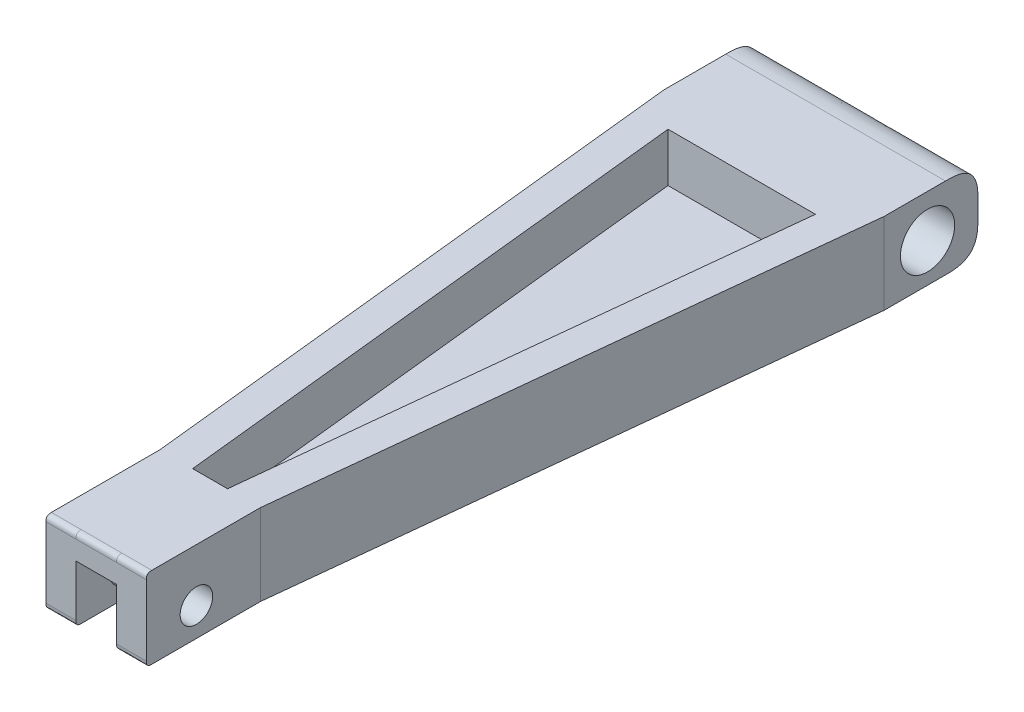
ISO-10303-21;
HEADER;
FILE_DESCRIPTION(('STEP AP214'),'2;1');
FILE_NAME('part.step','',(''),(''),'','','');
FILE_SCHEMA(('AUTOMOTIVE_DESIGN { 1 0 10303 214 1 1 1 1 }'));
ENDSEC;
DATA;
#1=APPLICATION_CONTEXT('core data for automotive mechanical design processes');
#2=APPLICATION_PROTOCOL_DEFINITION('international standard','automotive_design',2000,#1);
#3=PRODUCT_CONTEXT('',#1,'mechanical');
#4=PRODUCT('Part','Part','',(#3));
#5=PRODUCT_RELATED_PRODUCT_CATEGORY('part','',(#4));
#6=PRODUCT_DEFINITION_FORMATION('','',#4);
#7=PRODUCT_DEFINITION_CONTEXT('part definition',#1,'design');
#8=PRODUCT_DEFINITION('design','',#6,#7);
#9=PRODUCT_DEFINITION_SHAPE('','',#8);
#10=(LENGTH_UNIT() NAMED_UNIT(*) SI_UNIT(.MILLI.,.METRE.));
#11=(NAMED_UNIT(*) PLANE_ANGLE_UNIT() SI_UNIT($,.RADIAN.));
#12=(NAMED_UNIT(*) SI_UNIT($,.STERADIAN.) SOLID_ANGLE_UNIT());
#13=UNCERTAINTY_MEASURE_WITH_UNIT(LENGTH_MEASURE(1.E-05),#10,'distance_accuracy_value','');
#14=(GEOMETRIC_REPRESENTATION_CONTEXT(3) GLOBAL_UNCERTAINTY_ASSIGNED_CONTEXT((#13)) GLOBAL_UNIT_ASSIGNED_CONTEXT((#10,
#11,#12)) REPRESENTATION_CONTEXT('',''));
#15=CARTESIAN_POINT('',(0.,0.,0.));
#16=DIRECTION('',(0.,0.,1.));
#17=DIRECTION('',(1.,0.,0.));
#18=AXIS2_PLACEMENT_3D('',#15,#16,#17);
#19=CARTESIAN_POINT('',(55.,150.,0.));
#20=DIRECTION('',(-1.,0.,0.));
#21=DIRECTION('',(0.,0.,1.));
#22=AXIS2_PLACEMENT_3D('',#19,#20,#21);
#23=PLANE('',#22);
#24=CARTESIAN_POINT('',(55.,52.6570026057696,-92.2859315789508));
#25=DIRECTION('',(-1.,0.,0.));
#26=DIRECTION('',(0.,0.,1.));
#27=AXIS2_PLACEMENT_3D('',#24,#25,#26);
#28=CIRCLE('',#27,30.);
#29=CARTESIAN_POINT('',(55.,52.6570026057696,-62.2859315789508));
#30=VERTEX_POINT('',#29);
#31=EDGE_CURVE('E568',#30,#30,#28,.T.);
#32=ORIENTED_EDGE('',*,*,#31,.T.);
#33=EDGE_LOOP('',(#32));
#34=FACE_BOUND('',#33,.T.);
#35=DIRECTION('',(0.,0.,-1.));
#36=VECTOR('',#35,1.);
#37=CARTESIAN_POINT('',(55.,105.,0.));
#38=LINE('',#37,#36);
#39=CARTESIAN_POINT('',(55.,105.,0.));
#40=VERTEX_POINT('',#39);
#41=CARTESIAN_POINT('',(55.,105.,-200.));
#42=VERTEX_POINT('',#41);
#43=EDGE_CURVE('E556',#40,#42,#38,.T.);
#44=ORIENTED_EDGE('',*,*,#43,.F.);
#45=DIRECTION('',(0.,-1.,0.));
#46=VECTOR('',#45,1.);
#47=CARTESIAN_POINT('',(55.,150.,0.));
#48=LINE('',#47,#46);
#49=CARTESIAN_POINT('',(55.,10.,0.));
#50=VERTEX_POINT('',#49);
#51=EDGE_CURVE('E740',#40,#50,#48,.T.);
#52=ORIENTED_EDGE('',*,*,#51,.T.);
#53=CARTESIAN_POINT('',(54.9999999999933,0.,-10.));
#54=CARTESIAN_POINT('',(54.9999999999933,0.,-8.31801948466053));
#55=CARTESIAN_POINT('',(54.9999999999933,0.,-6.63603896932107));
#56=CARTESIAN_POINT('',(55.0000000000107,0.716919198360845,-2.92893218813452));
#57=CARTESIAN_POINT('',(55.0000000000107,2.92893218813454,-0.716919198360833));
#58=CARTESIAN_POINT('',(54.9999999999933,6.63603896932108,0.));
#59=CARTESIAN_POINT('',(54.9999999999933,8.31801948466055,0.));
#60=CARTESIAN_POINT('',(54.9999999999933,10.,0.));
#61=B_SPLINE_CURVE_WITH_KNOTS('',5,(#53,#54,#55,#56,#57,#58,#59,#60),.UNSPECIFIED.,.F.,.F.,(6,2,
6),(0.,0.5,1.),.UNSPECIFIED.);
#62=CARTESIAN_POINT('',(55.,0.,-10.));
#63=VERTEX_POINT('',#62);
#64=EDGE_CURVE('E702',#50,#63,#61,.F.);
#65=ORIENTED_EDGE('',*,*,#64,.T.);
#66=DIRECTION('',(0.,0.,-1.));
#67=VECTOR('',#66,1.);
#68=CARTESIAN_POINT('',(55.,0.,0.));
#69=LINE('',#68,#67);
#70=CARTESIAN_POINT('',(55.,0.,-270.));
#71=VERTEX_POINT('',#70);
#72=EDGE_CURVE('E78',#63,#71,#69,.T.);
#73=ORIENTED_EDGE('',*,*,#72,.T.);
#74=CARTESIAN_POINT('',(55.,70.,-200.));
#75=CARTESIAN_POINT('',(55.,0.,-200.));
#76=CARTESIAN_POINT('',(55.,0.,-270.));
#77=(BOUNDED_CURVE() B_SPLINE_CURVE(2,(#74,#75,#76),.UNSPECIFIED.,.F.,
.F.) B_SPLINE_CURVE_WITH_KNOTS((3,3),(0.,1.),
.UNSPECIFIED.) CURVE() GEOMETRIC_REPRESENTATION_ITEM() RATIONAL_B_SPLINE_CURVE((1.,
0.0526315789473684,1.)) REPRESENTATION_ITEM(''));
#78=CARTESIAN_POINT('',(55.,70.,-200.));
#79=VERTEX_POINT('',#78);
#80=EDGE_CURVE('E12',#71,#79,#77,.F.);
#81=ORIENTED_EDGE('',*,*,#80,.T.);
#82=DIRECTION('',(0.,-1.,0.));
#83=VECTOR('',#82,1.);
#84=CARTESIAN_POINT('',(55.,150.,-200.));
#85=LINE('',#84,#83);
#86=EDGE_CURVE('E637',#42,#79,#85,.T.);
#87=ORIENTED_EDGE('',*,*,#86,.F.);
#88=EDGE_LOOP('',(#44,#52,#65,#73,#81,#87));
#89=FACE_BOUND('',#88,.T.);
#90=ADVANCED_FACE('F49',(#34,#89),#23,.F.);
#91=CARTESIAN_POINT('',(55.,150.,-200.));
#92=DIRECTION('',(0.,0.,-1.));
#93=DIRECTION('',(-1.,0.,0.));
#94=AXIS2_PLACEMENT_3D('',#91,#92,#93);
#95=PLANE('',#94);
#96=ORIENTED_EDGE('',*,*,#86,.T.);
#97=CARTESIAN_POINT('',(133.75,70.,-200.));
#98=CARTESIAN_POINT('',(106.25,70.,-200.));
#99=CARTESIAN_POINT('',(78.7499999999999,70.,-200.));
#100=CARTESIAN_POINT('',(51.25,70.,-200.));
#101=(BOUNDED_CURVE() B_SPLINE_CURVE(3,(#97,#98,#99,#100),.UNSPECIFIED.,.F.,
.F.) B_SPLINE_CURVE_WITH_KNOTS((4,4),(-0.00375,0.07875),
.UNSPECIFIED.) CURVE() GEOMETRIC_REPRESENTATION_ITEM() RATIONAL_B_SPLINE_CURVE((1.,1.,1.,1.)) REPRESENTATION_ITEM(''));
#102=CARTESIAN_POINT('',(130.,70.,-200.));
#103=VERTEX_POINT('',#102);
#104=EDGE_CURVE('E628',#79,#103,#101,.F.);
#105=ORIENTED_EDGE('',*,*,#104,.T.);
#106=DIRECTION('',(0.,-1.,0.));
#107=VECTOR('',#106,1.);
#108=CARTESIAN_POINT('',(130.,150.,-200.));
#109=LINE('',#108,#107);
#110=CARTESIAN_POINT('',(130.,105.,-200.));
#111=VERTEX_POINT('',#110);
#112=EDGE_CURVE('E745',#111,#103,#109,.T.);
#113=ORIENTED_EDGE('',*,*,#112,.F.);
#114=DIRECTION('',(1.,0.,0.));
#115=VECTOR('',#114,1.);
#116=CARTESIAN_POINT('',(55.,105.,-200.));
#117=LINE('',#116,#115);
#118=EDGE_CURVE('E545',#42,#111,#117,.T.);
#119=ORIENTED_EDGE('',*,*,#118,.F.);
#120=EDGE_LOOP('',(#96,#105,#113,#119));
#121=FACE_BOUND('',#120,.T.);
#122=ADVANCED_FACE('F768',(#121),#95,.F.);
#123=CARTESIAN_POINT('',(130.,150.,-200.));
#124=DIRECTION('',(1.,0.,0.));
#125=DIRECTION('',(0.,0.,-1.));
#126=AXIS2_PLACEMENT_3D('',#123,#124,#125);
#127=PLANE('',#126);
#128=CARTESIAN_POINT('',(130.,52.6570026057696,-92.2859315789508));
#129=DIRECTION('',(1.,0.,0.));
#130=DIRECTION('',(0.,0.,-1.));
#131=AXIS2_PLACEMENT_3D('',#128,#129,#130);
#132=CIRCLE('',#131,30.);
#133=CARTESIAN_POINT('',(130.,52.6570026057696,-122.285931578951));
#134=VERTEX_POINT('',#133);
#135=EDGE_CURVE('E564',#134,#134,#132,.T.);
#136=ORIENTED_EDGE('',*,*,#135,.T.);
#137=EDGE_LOOP('',(#136));
#138=FACE_BOUND('',#137,.T.);
#139=DIRECTION('',(0.,0.,-1.));
#140=VECTOR('',#139,1.);
#141=CARTESIAN_POINT('',(130.,105.,0.));
#142=LINE('',#141,#140);
#143=CARTESIAN_POINT('',(130.,105.,0.));
#144=VERTEX_POINT('',#143);
#145=EDGE_CURVE('E550',#144,#111,#142,.T.);
#146=ORIENTED_EDGE('',*,*,#145,.T.);
#147=ORIENTED_EDGE('',*,*,#112,.T.);
#148=CARTESIAN_POINT('',(130.,0.,-270.));
#149=CARTESIAN_POINT('',(130.,0.,-200.));
#150=CARTESIAN_POINT('',(130.,70.,-200.));
#151=(BOUNDED_CURVE() B_SPLINE_CURVE(2,(#148,#149,#150),.UNSPECIFIED.,.F.,
.F.) B_SPLINE_CURVE_WITH_KNOTS((3,3),(0.,1.),
.UNSPECIFIED.) CURVE() GEOMETRIC_REPRESENTATION_ITEM() RATIONAL_B_SPLINE_CURVE((1.,
0.0526315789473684,1.)) REPRESENTATION_ITEM(''));
#152=CARTESIAN_POINT('',(130.,0.,-270.));
#153=VERTEX_POINT('',#152);
#154=EDGE_CURVE('E64',#103,#153,#151,.F.);
#155=ORIENTED_EDGE('',*,*,#154,.T.);
#156=DIRECTION('',(0.,0.,1.));
#157=VECTOR('',#156,1.);
#158=CARTESIAN_POINT('',(130.,0.,-200.));
#159=LINE('',#158,#157);
#160=CARTESIAN_POINT('',(130.,0.,-10.));
#161=VERTEX_POINT('',#160);
#162=EDGE_CURVE('E71',#153,#161,#159,.T.);
#163=ORIENTED_EDGE('',*,*,#162,.T.);
#164=CARTESIAN_POINT('',(130.,10.,0.));
#165=CARTESIAN_POINT('',(130.,8.31801948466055,0.));
#166=CARTESIAN_POINT('',(130.,6.63603896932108,0.));
#167=CARTESIAN_POINT('',(130.,2.92893218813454,-0.716919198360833));
#168=CARTESIAN_POINT('',(130.,0.716919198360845,-2.92893218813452));
#169=CARTESIAN_POINT('',(130.,0.,-6.63603896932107));
#170=CARTESIAN_POINT('',(130.,0.,-8.31801948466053));
#171=CARTESIAN_POINT('',(130.,0.,-9.99999999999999));
#172=B_SPLINE_CURVE_WITH_KNOTS('',5,(#164,#165,#166,#167,#168,#169,#170,#171),.UNSPECIFIED.,.F.,
.F.,(6,2,6),(0.,0.5,1.),.UNSPECIFIED.);
#173=CARTESIAN_POINT('',(130.,10.,0.));
#174=VERTEX_POINT('',#173);
#175=EDGE_CURVE('E727',#161,#174,#172,.F.);
#176=ORIENTED_EDGE('',*,*,#175,.T.);
#177=DIRECTION('',(0.,-1.,0.));
#178=VECTOR('',#177,1.);
#179=CARTESIAN_POINT('',(130.,150.,0.));
#180=LINE('',#179,#178);
#181=EDGE_CURVE('E280',#144,#174,#180,.T.);
#182=ORIENTED_EDGE('',*,*,#181,.F.);
#183=EDGE_LOOP('',(#146,#147,#155,#163,#176,#182));
#184=FACE_BOUND('',#183,.T.);
#185=ADVANCED_FACE('F777',(#138,#184),#127,.F.);
#186=CARTESIAN_POINT('',(0.,150.,0.));
#187=DIRECTION('',(1.,0.,0.));
#188=DIRECTION('',(0.,0.,-1.));
#189=AXIS2_PLACEMENT_3D('',#186,#187,#188);
#190=PLANE('',#189);
#191=CARTESIAN_POINT('',(0.,52.6570026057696,-92.2859315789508));
#192=DIRECTION('',(1.,0.,0.));
#193=DIRECTION('',(0.,0.,-1.));
#194=AXIS2_PLACEMENT_3D('',#191,#192,#193);
#195=CIRCLE('',#194,30.);
#196=CARTESIAN_POINT('',(0.,52.6570026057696,-122.285931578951));
#197=VERTEX_POINT('',#196);
#198=EDGE_CURVE('E378',#197,#197,#195,.T.);
#199=ORIENTED_EDGE('',*,*,#198,.T.);
#200=EDGE_LOOP('',(#199));
#201=FACE_BOUND('',#200,.T.);
#202=DIRECTION('',(0.,0.,1.));
#203=VECTOR('',#202,1.);
#204=CARTESIAN_POINT('',(0.,0.,0.));
#205=LINE('',#204,#203);
#206=CARTESIAN_POINT('',(0.,0.,-210.));
#207=VERTEX_POINT('',#206);
#208=CARTESIAN_POINT('',(0.,0.,-9.99999999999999));
#209=VERTEX_POINT('',#208);
#210=EDGE_CURVE('E375',#207,#209,#205,.T.);
#211=ORIENTED_EDGE('',*,*,#210,.T.);
#212=CARTESIAN_POINT('',(-3.19731220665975E-13,10.,0.));
#213=CARTESIAN_POINT('',(-3.19731220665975E-13,8.31801948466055,0.));
#214=CARTESIAN_POINT('',(-3.19731220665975E-13,6.63603896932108,0.));
#215=CARTESIAN_POINT('',(5.07948717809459E-13,2.92893218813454,-0.716919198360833));
#216=CARTESIAN_POINT('',(5.07948717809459E-13,0.716919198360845,-2.92893218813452));
#217=CARTESIAN_POINT('',(-3.19731220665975E-13,0.,-6.63603896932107));
#218=CARTESIAN_POINT('',(-3.19731220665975E-13,0.,-8.31801948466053));
#219=CARTESIAN_POINT('',(-3.19731220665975E-13,0.,-10.));
#220=B_SPLINE_CURVE_WITH_KNOTS('',5,(#212,#213,#214,#215,#216,#217,#218,#219),.UNSPECIFIED.,.F.,
.F.,(6,2,6),(0.,0.5,1.),.UNSPECIFIED.);
#221=CARTESIAN_POINT('',(0.,10.,0.));
#222=VERTEX_POINT('',#221);
#223=EDGE_CURVE('E691',#209,#222,#220,.F.);
#224=ORIENTED_EDGE('',*,*,#223,.T.);
#225=DIRECTION('',(0.,-1.,0.));
#226=VECTOR('',#225,1.);
#227=CARTESIAN_POINT('',(0.,150.,0.));
#228=LINE('',#227,#226);
#229=CARTESIAN_POINT('',(0.,140.,0.));
#230=VERTEX_POINT('',#229);
#231=EDGE_CURVE('E738',#230,#222,#228,.T.);
#232=ORIENTED_EDGE('',*,*,#231,.F.);
#233=CARTESIAN_POINT('',(-3.21899625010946E-13,150.,-10.));
#234=CARTESIAN_POINT('',(-3.21899625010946E-13,150.,-8.31801948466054));
#235=CARTESIAN_POINT('',(-3.21899625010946E-13,150.,-6.63603896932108));
#236=CARTESIAN_POINT('',(5.05888733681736E-13,149.283080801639,-2.92893218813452));
#237=CARTESIAN_POINT('',(5.05888733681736E-13,147.071067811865,-0.716919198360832));
#238=CARTESIAN_POINT('',(-3.21899625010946E-13,143.363961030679,0.));
#239=CARTESIAN_POINT('',(-3.21899625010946E-13,141.681980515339,0.));
#240=CARTESIAN_POINT('',(-3.21899625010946E-13,140.,0.));
#241=B_SPLINE_CURVE_WITH_KNOTS('',5,(#233,#234,#235,#236,#237,#238,#239,#240),.UNSPECIFIED.,.F.,
.F.,(6,2,6),(0.,0.5,1.),.UNSPECIFIED.);
#242=CARTESIAN_POINT('',(0.,150.,-10.));
#243=VERTEX_POINT('',#242);
#244=EDGE_CURVE('E696',#230,#243,#241,.F.);
#245=ORIENTED_EDGE('',*,*,#244,.T.);
#246=DIRECTION('',(0.,0.,1.));
#247=VECTOR('',#246,1.);
#248=CARTESIAN_POINT('',(0.,150.,0.));
#249=LINE('',#248,#247);
#250=CARTESIAN_POINT('',(0.,150.,-210.));
#251=VERTEX_POINT('',#250);
#252=EDGE_CURVE('E354',#251,#243,#249,.T.);
#253=ORIENTED_EDGE('',*,*,#252,.F.);
#254=DIRECTION('',(0.,-1.,0.));
#255=VECTOR('',#254,1.);
#256=CARTESIAN_POINT('',(0.,150.,-210.));
#257=LINE('',#256,#255);
#258=EDGE_CURVE('E267',#251,#207,#257,.T.);
#259=ORIENTED_EDGE('',*,*,#258,.T.);
#260=EDGE_LOOP('',(#211,#224,#232,#245,#253,#259));
#261=FACE_BOUND('',#260,.T.);
#262=ADVANCED_FACE('F783',(#201,#261),#190,.F.);
#263=CARTESIAN_POINT('',(130.,150.,0.));
#264=DIRECTION('',(0.,0.,-1.));
#265=DIRECTION('',(-1.,0.,0.));
#266=AXIS2_PLACEMENT_3D('',#263,#264,#265);
#267=PLANE('',#266);
#268=CARTESIAN_POINT('',(127.25,140.,0.));
#269=CARTESIAN_POINT('',(147.416666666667,140.,0.));
#270=CARTESIAN_POINT('',(167.583333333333,140.,0.));
#271=CARTESIAN_POINT('',(187.75,140.,0.));
#272=B_SPLINE_CURVE_WITH_KNOTS('',3,(#268,#269,#270,#271),.UNSPECIFIED.,.F.,.F.,(4,4),(-0.18775,
-0.12725),.UNSPECIFIED.);
#273=CARTESIAN_POINT('',(185.,140.,0.));
#274=VERTEX_POINT('',#273);
#275=CARTESIAN_POINT('',(130.,140.,0.));
#276=VERTEX_POINT('',#275);
#277=EDGE_CURVE('E332',#274,#276,#272,.F.);
#278=ORIENTED_EDGE('',*,*,#277,.T.);
#279=CARTESIAN_POINT('',(51.25,140.,0.));
#280=CARTESIAN_POINT('',(78.75,140.,0.));
#281=CARTESIAN_POINT('',(106.249999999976,140.,0.));
#282=CARTESIAN_POINT('',(133.75,140.,0.));
#283=B_SPLINE_CURVE_WITH_KNOTS('',3,(#279,#280,#281,#282),.UNSPECIFIED.,.F.,.F.,(4,4),(-0.07875,
0.00375),.UNSPECIFIED.);
#284=CARTESIAN_POINT('',(55.,140.,0.));
#285=VERTEX_POINT('',#284);
#286=EDGE_CURVE('E689',#276,#285,#283,.F.);
#287=ORIENTED_EDGE('',*,*,#286,.T.);
#288=CARTESIAN_POINT('',(-2.75,140.,0.));
#289=CARTESIAN_POINT('',(17.4166666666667,140.,0.));
#290=CARTESIAN_POINT('',(37.5833333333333,140.,0.));
#291=CARTESIAN_POINT('',(57.75,140.,0.));
#292=B_SPLINE_CURVE_WITH_KNOTS('',3,(#288,#289,#290,#291),.UNSPECIFIED.,.F.,.F.,(4,4),(-0.05775,
0.00275),.UNSPECIFIED.);
#293=EDGE_CURVE('E715',#285,#230,#292,.F.);
#294=ORIENTED_EDGE('',*,*,#293,.T.);
#295=ORIENTED_EDGE('',*,*,#231,.T.);
#296=CARTESIAN_POINT('',(57.75,10.,0.));
#297=CARTESIAN_POINT('',(37.5833333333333,10.,0.));
#298=CARTESIAN_POINT('',(17.4166666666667,10.,0.));
#299=CARTESIAN_POINT('',(-2.75,10.,0.));
#300=B_SPLINE_CURVE_WITH_KNOTS('',3,(#296,#297,#298,#299),.UNSPECIFIED.,.F.,.F.,(4,4),(-0.00275,
0.05775),.UNSPECIFIED.);
#301=EDGE_CURVE('E710',#222,#50,#300,.F.);
#302=ORIENTED_EDGE('',*,*,#301,.T.);
#303=ORIENTED_EDGE('',*,*,#51,.F.);
#304=DIRECTION('',(1.,0.,0.));
#305=VECTOR('',#304,1.);
#306=CARTESIAN_POINT('',(55.,105.,0.));
#307=LINE('',#306,#305);
#308=EDGE_CURVE('E546',#40,#144,#307,.T.);
#309=ORIENTED_EDGE('',*,*,#308,.T.);
#310=ORIENTED_EDGE('',*,*,#181,.T.);
#311=CARTESIAN_POINT('',(187.75,10.,0.));
#312=CARTESIAN_POINT('',(167.583333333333,10.,0.));
#313=CARTESIAN_POINT('',(147.416666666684,10.,0.));
#314=CARTESIAN_POINT('',(127.25,10.,0.));
#315=B_SPLINE_CURVE_WITH_KNOTS('',3,(#311,#312,#313,#314),.UNSPECIFIED.,.F.,.F.,(4,4),(-0.00275,
0.05775),.UNSPECIFIED.);
#316=CARTESIAN_POINT('',(185.,10.,0.));
#317=VERTEX_POINT('',#316);
#318=EDGE_CURVE('E320',#174,#317,#315,.F.);
#319=ORIENTED_EDGE('',*,*,#318,.T.);
#320=DIRECTION('',(0.,-1.,0.));
#321=VECTOR('',#320,1.);
#322=CARTESIAN_POINT('',(185.,150.,0.));
#323=LINE('',#322,#321);
#324=EDGE_CURVE('E264',#274,#317,#323,.T.);
#325=ORIENTED_EDGE('',*,*,#324,.F.);
#326=EDGE_LOOP('',(#278,#287,#294,#295,#302,#303,#309,#310,#319,#325));
#327=FACE_BOUND('',#326,.T.);
#328=ADVANCED_FACE('F301',(#327),#267,.F.);
#329=CARTESIAN_POINT('',(185.,150.,0.));
#330=DIRECTION('',(-1.,0.,0.));
#331=DIRECTION('',(0.,0.,1.));
#332=AXIS2_PLACEMENT_3D('',#329,#330,#331);
#333=PLANE('',#332);
#334=CARTESIAN_POINT('',(185.,52.6570026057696,-92.2859315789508));
#335=DIRECTION('',(1.,0.,0.));
#336=DIRECTION('',(0.,0.,-1.));
#337=AXIS2_PLACEMENT_3D('',#334,#335,#336);
#338=CIRCLE('',#337,30.);
#339=CARTESIAN_POINT('',(185.,52.6570026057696,-122.285931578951));
#340=VERTEX_POINT('',#339);
#341=EDGE_CURVE('E560',#340,#340,#338,.T.);
#342=ORIENTED_EDGE('',*,*,#341,.F.);
#343=EDGE_LOOP('',(#342));
#344=FACE_BOUND('',#343,.T.);
#345=DIRECTION('',(0.,0.,-1.));
#346=VECTOR('',#345,1.);
#347=CARTESIAN_POINT('',(185.,150.,0.));
#348=LINE('',#347,#346);
#349=CARTESIAN_POINT('',(185.,150.,-9.99999999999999));
#350=VERTEX_POINT('',#349);
#351=CARTESIAN_POINT('',(185.,150.,-210.));
#352=VERTEX_POINT('',#351);
#353=EDGE_CURVE('E370',#350,#352,#348,.T.);
#354=ORIENTED_EDGE('',*,*,#353,.F.);
#355=CARTESIAN_POINT('',(185.,140.,0.));
#356=CARTESIAN_POINT('',(185.,141.681980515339,0.));
#357=CARTESIAN_POINT('',(185.,143.363961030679,0.));
#358=CARTESIAN_POINT('',(185.,147.071067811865,-0.716919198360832));
#359=CARTESIAN_POINT('',(185.,149.283080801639,-2.92893218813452));
#360=CARTESIAN_POINT('',(185.,150.,-6.63603896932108));
#361=CARTESIAN_POINT('',(185.,150.,-8.31801948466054));
#362=CARTESIAN_POINT('',(185.,150.,-9.99999999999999));
#363=B_SPLINE_CURVE_WITH_KNOTS('',5,(#355,#356,#357,#358,#359,#360,#361,#362),.UNSPECIFIED.,.F.,
.F.,(6,2,6),(0.,0.5,1.),.UNSPECIFIED.);
#364=EDGE_CURVE('E615',#350,#274,#363,.F.);
#365=ORIENTED_EDGE('',*,*,#364,.T.);
#366=ORIENTED_EDGE('',*,*,#324,.T.);
#367=CARTESIAN_POINT('',(185.,0.,-10.));
#368=CARTESIAN_POINT('',(185.,0.,-8.31801948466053));
#369=CARTESIAN_POINT('',(185.,0.,-6.63603896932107));
#370=CARTESIAN_POINT('',(185.,0.716919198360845,-2.92893218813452));
#371=CARTESIAN_POINT('',(185.,2.92893218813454,-0.716919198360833));
#372=CARTESIAN_POINT('',(185.,6.63603896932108,0.));
#373=CARTESIAN_POINT('',(185.,8.31801948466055,0.));
#374=CARTESIAN_POINT('',(185.,10.,0.));
#375=B_SPLINE_CURVE_WITH_KNOTS('',5,(#367,#368,#369,#370,#371,#372,#373,#374),.UNSPECIFIED.,.F.,
.F.,(6,2,6),(0.,0.5,1.),.UNSPECIFIED.);
#376=CARTESIAN_POINT('',(185.,0.,-10.));
#377=VERTEX_POINT('',#376);
#378=EDGE_CURVE('E285',#317,#377,#375,.F.);
#379=ORIENTED_EDGE('',*,*,#378,.T.);
#380=DIRECTION('',(0.,0.,-1.));
#381=VECTOR('',#380,1.);
#382=CARTESIAN_POINT('',(185.,0.,0.));
#383=LINE('',#382,#381);
#384=CARTESIAN_POINT('',(185.,0.,-210.));
#385=VERTEX_POINT('',#384);
#386=EDGE_CURVE('E253',#377,#385,#383,.T.);
#387=ORIENTED_EDGE('',*,*,#386,.T.);
#388=DIRECTION('',(0.,-1.,0.));
#389=VECTOR('',#388,1.);
#390=CARTESIAN_POINT('',(185.,150.,-210.));
#391=LINE('',#390,#389);
#392=EDGE_CURVE('E250',#352,#385,#391,.T.);
#393=ORIENTED_EDGE('',*,*,#392,.F.);
#394=EDGE_LOOP('',(#354,#365,#366,#379,#387,#393));
#395=FACE_BOUND('',#394,.T.);
#396=ADVANCED_FACE('F291',(#344,#395),#333,.F.);
#397=CARTESIAN_POINT('',(185.,150.,-210.));
#398=DIRECTION('',(-0.994452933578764,0.,-0.105182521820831));
#399=DIRECTION('',(-0.105182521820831,0.,0.994452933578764));
#400=AXIS2_PLACEMENT_3D('',#397,#398,#399);
#401=PLANE('',#400);
#402=DIRECTION('',(0.105182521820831,0.,-0.994452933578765));
#403=VECTOR('',#402,1.);
#404=CARTESIAN_POINT('',(185.,0.,-210.));
#405=LINE('',#404,#403);
#406=CARTESIAN_POINT('',(295.,0.,-1250.));
#407=VERTEX_POINT('',#406);
#408=EDGE_CURVE('E231',#385,#407,#405,.T.);
#409=ORIENTED_EDGE('',*,*,#408,.T.);
#410=DIRECTION('',(0.,-1.,0.));
#411=VECTOR('',#410,1.);
#412=CARTESIAN_POINT('',(295.,150.,-1250.));
#413=LINE('',#412,#411);
#414=CARTESIAN_POINT('',(295.,150.,-1250.));
#415=VERTEX_POINT('',#414);
#416=EDGE_CURVE('E248',#415,#407,#413,.T.);
#417=ORIENTED_EDGE('',*,*,#416,.F.);
#418=DIRECTION('',(0.105182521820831,0.,-0.994452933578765));
#419=VECTOR('',#418,1.);
#420=CARTESIAN_POINT('',(185.,150.,-210.));
#421=LINE('',#420,#419);
#422=EDGE_CURVE('E364',#352,#415,#421,.T.);
#423=ORIENTED_EDGE('',*,*,#422,.F.);
#424=ORIENTED_EDGE('',*,*,#392,.T.);
#425=EDGE_LOOP('',(#409,#417,#423,#424));
#426=FACE_BOUND('',#425,.T.);
#427=ADVANCED_FACE('F246',(#426),#401,.F.);
#428=CARTESIAN_POINT('',(0.,150.,-210.));
#429=DIRECTION('',(0.994452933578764,0.,-0.105182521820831));
#430=DIRECTION('',(-0.105182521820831,0.,-0.994452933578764));
#431=AXIS2_PLACEMENT_3D('',#428,#429,#430);
#432=PLANE('',#431);
#433=DIRECTION('',(0.105182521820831,0.,0.994452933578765));
#434=VECTOR('',#433,1.);
#435=CARTESIAN_POINT('',(0.,0.,-210.));
#436=LINE('',#435,#434);
#437=CARTESIAN_POINT('',(-110.,0.,-1250.));
#438=VERTEX_POINT('',#437);
#439=EDGE_CURVE('E252',#438,#207,#436,.T.);
#440=ORIENTED_EDGE('',*,*,#439,.T.);
#441=ORIENTED_EDGE('',*,*,#258,.F.);
#442=DIRECTION('',(0.105182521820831,0.,0.994452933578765));
#443=VECTOR('',#442,1.);
#444=CARTESIAN_POINT('',(0.,150.,-210.));
#445=LINE('',#444,#443);
#446=CARTESIAN_POINT('',(-110.,150.,-1250.));
#447=VERTEX_POINT('',#446);
#448=EDGE_CURVE('E357',#447,#251,#445,.T.);
#449=ORIENTED_EDGE('',*,*,#448,.F.);
#450=DIRECTION('',(0.,-1.,0.));
#451=VECTOR('',#450,1.);
#452=CARTESIAN_POINT('',(-110.,150.,-1250.));
#453=LINE('',#452,#451);
#454=EDGE_CURVE('E260',#447,#438,#453,.T.);
#455=ORIENTED_EDGE('',*,*,#454,.T.);
#456=EDGE_LOOP('',(#440,#441,#449,#455));
#457=FACE_BOUND('',#456,.T.);
#458=ADVANCED_FACE('F403',(#457),#432,.F.);
#459=CARTESIAN_POINT('',(0.,150.,0.));
#460=DIRECTION('',(0.,1.,0.));
#461=DIRECTION('',(0.,0.,1.));
#462=AXIS2_PLACEMENT_3D('',#459,#460,#461);
#463=PLANE('',#462);
#464=DIRECTION('',(0.,0.,1.));
#465=VECTOR('',#464,1.);
#466=CARTESIAN_POINT('',(60.,150.,0.));
#467=LINE('',#466,#465);
#468=CARTESIAN_POINT('',(60.,150.,-213.164251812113));
#469=VERTEX_POINT('',#468);
#470=CARTESIAN_POINT('',(60.,150.,-210.));
#471=VERTEX_POINT('',#470);
#472=EDGE_CURVE('E500',#469,#471,#467,.T.);
#473=ORIENTED_EDGE('',*,*,#472,.F.);
#474=DIRECTION('',(0.105182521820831,0.,0.994452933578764));
#475=VECTOR('',#474,1.);
#476=CARTESIAN_POINT('',(59.6671760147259,150.,-216.31095130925));
#477=LINE('',#476,#475);
#478=CARTESIAN_POINT('',(-43.3191656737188,150.,-1190.));
#479=VERTEX_POINT('',#478);
#480=EDGE_CURVE('E495',#479,#469,#477,.T.);
#481=ORIENTED_EDGE('',*,*,#480,.F.);
#482=DIRECTION('',(-1.,0.,0.));
#483=VECTOR('',#482,1.);
#484=CARTESIAN_POINT('',(295.,150.,-1190.));
#485=LINE('',#484,#483);
#486=CARTESIAN_POINT('',(228.319165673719,150.,-1190.));
#487=VERTEX_POINT('',#486);
#488=EDGE_CURVE('E527',#487,#479,#485,.T.);
#489=ORIENTED_EDGE('',*,*,#488,.F.);
#490=DIRECTION('',(0.105182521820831,0.,-0.994452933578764));
#491=VECTOR('',#490,1.);
#492=CARTESIAN_POINT('',(125.332823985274,150.,-216.31095130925));
#493=LINE('',#492,#491);
#494=CARTESIAN_POINT('',(125.,150.,-213.164251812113));
#495=VERTEX_POINT('',#494);
#496=EDGE_CURVE('E524',#495,#487,#493,.T.);
#497=ORIENTED_EDGE('',*,*,#496,.F.);
#498=DIRECTION('',(0.,0.,-1.));
#499=VECTOR('',#498,1.);
#500=CARTESIAN_POINT('',(125.,150.,0.));
#501=LINE('',#500,#499);
#502=CARTESIAN_POINT('',(125.,150.,-210.));
#503=VERTEX_POINT('',#502);
#504=EDGE_CURVE('E521',#503,#495,#501,.T.);
#505=ORIENTED_EDGE('',*,*,#504,.F.);
#506=DIRECTION('',(1.,0.,0.));
#507=VECTOR('',#506,1.);
#508=CARTESIAN_POINT('',(55.,150.,-210.));
#509=LINE('',#508,#507);
#510=EDGE_CURVE('E541',#471,#503,#509,.T.);
#511=ORIENTED_EDGE('',*,*,#510,.F.);
#512=EDGE_LOOP('',(#473,#481,#489,#497,#505,#511));
#513=FACE_BOUND('',#512,.T.);
#514=DIRECTION('',(0.,0.,1.));
#515=VECTOR('',#514,1.);
#516=CARTESIAN_POINT('',(295.,150.,-1423.));
#517=LINE('',#516,#515);
#518=CARTESIAN_POINT('',(295.,150.,-1363.));
#519=VERTEX_POINT('',#518);
#520=EDGE_CURVE('E257',#519,#415,#517,.T.);
#521=ORIENTED_EDGE('',*,*,#520,.F.);
#522=CARTESIAN_POINT('',(-130.25,150.,-1363.));
#523=CARTESIAN_POINT('',(18.25,150.,-1363.));
#524=CARTESIAN_POINT('',(166.75,150.,-1363.));
#525=CARTESIAN_POINT('',(315.25,150.,-1363.));
#526=B_SPLINE_CURVE_WITH_KNOTS('',3,(#522,#523,#524,#525),.UNSPECIFIED.,.F.,.F.,(4,4),(-0.13025,
0.31525),.UNSPECIFIED.);
#527=CARTESIAN_POINT('',(-110.,150.,-1363.));
#528=VERTEX_POINT('',#527);
#529=EDGE_CURVE('E617',#519,#528,#526,.F.);
#530=ORIENTED_EDGE('',*,*,#529,.T.);
#531=DIRECTION('',(0.,0.,1.));
#532=VECTOR('',#531,1.);
#533=CARTESIAN_POINT('',(-110.,150.,-1423.));
#534=LINE('',#533,#532);
#535=EDGE_CURVE('E423',#528,#447,#534,.T.);
#536=ORIENTED_EDGE('',*,*,#535,.T.);
#537=ORIENTED_EDGE('',*,*,#448,.T.);
#538=ORIENTED_EDGE('',*,*,#252,.T.);
#539=CARTESIAN_POINT('',(57.75,150.,-10.));
#540=CARTESIAN_POINT('',(37.5833333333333,150.,-10.));
#541=CARTESIAN_POINT('',(17.4166666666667,150.,-10.));
#542=CARTESIAN_POINT('',(-2.75,150.,-10.));
#543=B_SPLINE_CURVE_WITH_KNOTS('',3,(#539,#540,#541,#542),.UNSPECIFIED.,.F.,.F.,(4,4),(-0.05775,
0.00275),.UNSPECIFIED.);
#544=CARTESIAN_POINT('',(55.,150.,-10.));
#545=VERTEX_POINT('',#544);
#546=EDGE_CURVE('E588',#243,#545,#543,.F.);
#547=ORIENTED_EDGE('',*,*,#546,.T.);
#548=CARTESIAN_POINT('',(133.75,150.,-10.));
#549=CARTESIAN_POINT('',(106.249999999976,150.,-10.));
#550=CARTESIAN_POINT('',(78.75,150.,-10.));
#551=CARTESIAN_POINT('',(51.25,150.,-10.));
#552=B_SPLINE_CURVE_WITH_KNOTS('',3,(#548,#549,#550,#551),.UNSPECIFIED.,.F.,.F.,(4,4),(-0.07875,
0.00375),.UNSPECIFIED.);
#553=CARTESIAN_POINT('',(130.,150.,-9.99999999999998));
#554=VERTEX_POINT('',#553);
#555=EDGE_CURVE('E609',#545,#554,#552,.F.);
#556=ORIENTED_EDGE('',*,*,#555,.T.);
#557=CARTESIAN_POINT('',(187.75,150.,-10.));
#558=CARTESIAN_POINT('',(167.583333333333,150.,-10.));
#559=CARTESIAN_POINT('',(147.416666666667,150.,-10.));
#560=CARTESIAN_POINT('',(127.25,150.,-10.));
#561=B_SPLINE_CURVE_WITH_KNOTS('',3,(#557,#558,#559,#560),.UNSPECIFIED.,.F.,.F.,(4,4),(-0.18775,
-0.12725),.UNSPECIFIED.);
#562=EDGE_CURVE('E600',#554,#350,#561,.F.);
#563=ORIENTED_EDGE('',*,*,#562,.T.);
#564=ORIENTED_EDGE('',*,*,#353,.T.);
#565=ORIENTED_EDGE('',*,*,#422,.T.);
#566=EDGE_LOOP('',(#521,#530,#536,#537,#538,#547,#556,#563,#564,#565));
#567=FACE_BOUND('',#566,.T.);
#568=ADVANCED_FACE('F400',(#513,#567),#463,.T.);
#569=CARTESIAN_POINT('',(0.,0.,0.));
#570=DIRECTION('',(0.,1.,0.));
#571=DIRECTION('',(0.,0.,1.));
#572=AXIS2_PLACEMENT_3D('',#569,#570,#571);
#573=PLANE('',#572);
#574=ORIENTED_EDGE('',*,*,#162,.F.);
#575=CARTESIAN_POINT('',(51.25,0.,-270.));
#576=CARTESIAN_POINT('',(78.7499999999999,0.,-270.));
#577=CARTESIAN_POINT('',(106.25,0.,-270.));
#578=CARTESIAN_POINT('',(133.75,0.,-270.));
#579=(BOUNDED_CURVE() B_SPLINE_CURVE(3,(#575,#576,#577,#578),.UNSPECIFIED.,.F.,
.F.) B_SPLINE_CURVE_WITH_KNOTS((4,4),(-0.00375,0.07875),
.UNSPECIFIED.) CURVE() GEOMETRIC_REPRESENTATION_ITEM() RATIONAL_B_SPLINE_CURVE((1.,1.,1.,1.)) REPRESENTATION_ITEM(''));
#580=EDGE_CURVE('E830',#153,#71,#579,.F.);
#581=ORIENTED_EDGE('',*,*,#580,.T.);
#582=ORIENTED_EDGE('',*,*,#72,.F.);
#583=CARTESIAN_POINT('',(-2.75,0.,-10.));
#584=CARTESIAN_POINT('',(17.4166666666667,0.,-10.));
#585=CARTESIAN_POINT('',(37.5833333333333,0.,-10.));
#586=CARTESIAN_POINT('',(57.75,0.,-10.));
#587=B_SPLINE_CURVE_WITH_KNOTS('',3,(#583,#584,#585,#586),.UNSPECIFIED.,.F.,.F.,(4,4),(-0.00275,
0.05775),.UNSPECIFIED.);
#588=EDGE_CURVE('E385',#63,#209,#587,.F.);
#589=ORIENTED_EDGE('',*,*,#588,.T.);
#590=ORIENTED_EDGE('',*,*,#210,.F.);
#591=ORIENTED_EDGE('',*,*,#439,.F.);
#592=DIRECTION('',(0.,0.,1.));
#593=VECTOR('',#592,1.);
#594=CARTESIAN_POINT('',(-110.,0.,-1423.));
#595=LINE('',#594,#593);
#596=CARTESIAN_POINT('',(-110.,0.,-1363.));
#597=VERTEX_POINT('',#596);
#598=EDGE_CURVE('E241',#597,#438,#595,.T.);
#599=ORIENTED_EDGE('',*,*,#598,.F.);
#600=CARTESIAN_POINT('',(315.25,0.,-1363.));
#601=CARTESIAN_POINT('',(166.75,0.,-1363.));
#602=CARTESIAN_POINT('',(18.25,0.,-1363.));
#603=CARTESIAN_POINT('',(-130.25,0.,-1363.));
#604=B_SPLINE_CURVE_WITH_KNOTS('',3,(#600,#601,#602,#603),.UNSPECIFIED.,.F.,.F.,(4,4),(-0.13025,
0.31525),.UNSPECIFIED.);
#605=CARTESIAN_POINT('',(295.,0.,-1363.));
#606=VERTEX_POINT('',#605);
#607=EDGE_CURVE('E234',#597,#606,#604,.F.);
#608=ORIENTED_EDGE('',*,*,#607,.T.);
#609=DIRECTION('',(0.,0.,1.));
#610=VECTOR('',#609,1.);
#611=CARTESIAN_POINT('',(295.,0.,-1423.));
#612=LINE('',#611,#610);
#613=EDGE_CURVE('E227',#606,#407,#612,.T.);
#614=ORIENTED_EDGE('',*,*,#613,.T.);
#615=ORIENTED_EDGE('',*,*,#408,.F.);
#616=ORIENTED_EDGE('',*,*,#386,.F.);
#617=CARTESIAN_POINT('',(127.25,0.,-10.));
#618=CARTESIAN_POINT('',(147.416666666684,0.,-10.));
#619=CARTESIAN_POINT('',(167.583333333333,0.,-10.));
#620=CARTESIAN_POINT('',(187.75,0.,-10.));
#621=B_SPLINE_CURVE_WITH_KNOTS('',3,(#617,#618,#619,#620),.UNSPECIFIED.,.F.,.F.,(4,4),(-0.00275,
0.05775),.UNSPECIFIED.);
#622=EDGE_CURVE('E720',#377,#161,#621,.F.);
#623=ORIENTED_EDGE('',*,*,#622,.T.);
#624=EDGE_LOOP('',(#574,#581,#582,#589,#590,#591,#599,#608,#614,#615,#616,#623));
#625=FACE_BOUND('',#624,.T.);
#626=ADVANCED_FACE('F229',(#625),#573,.F.);
#627=CARTESIAN_POINT('',(-110.,52.6570026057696,-92.2859315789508));
#628=DIRECTION('',(1.,0.,0.));
#629=DIRECTION('',(0.,0.,-1.));
#630=AXIS2_PLACEMENT_3D('',#627,#628,#629);
#631=CYLINDRICAL_SURFACE('',#630,30.);
#632=ORIENTED_EDGE('',*,*,#341,.T.);
#633=EDGE_LOOP('',(#632));
#634=FACE_BOUND('',#633,.T.);
#635=ORIENTED_EDGE('',*,*,#135,.F.);
#636=EDGE_LOOP('',(#635));
#637=FACE_BOUND('',#636,.T.);
#638=ADVANCED_FACE('F399',(#634,#637),#631,.F.);
#639=ORIENTED_EDGE('',*,*,#31,.F.);
#640=EDGE_LOOP('',(#639));
#641=FACE_BOUND('',#640,.T.);
#642=ORIENTED_EDGE('',*,*,#198,.F.);
#643=EDGE_LOOP('',(#642));
#644=FACE_BOUND('',#643,.T.);
#645=ADVANCED_FACE('F957',(#641,#644),#631,.F.);
#646=CARTESIAN_POINT('',(187.75,140.,0.));
#647=CARTESIAN_POINT('',(167.583333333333,140.,0.));
#648=CARTESIAN_POINT('',(147.416666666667,140.,0.));
#649=CARTESIAN_POINT('',(127.25,140.,0.));
#650=CARTESIAN_POINT('',(187.75,141.681980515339,0.));
#651=CARTESIAN_POINT('',(167.583333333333,141.681980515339,0.));
#652=CARTESIAN_POINT('',(147.416666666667,141.681980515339,0.));
#653=CARTESIAN_POINT('',(127.25,141.681980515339,0.));
#654=CARTESIAN_POINT('',(187.75,143.363961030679,0.));
#655=CARTESIAN_POINT('',(167.583333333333,143.363961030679,0.));
#656=CARTESIAN_POINT('',(147.416666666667,143.363961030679,0.));
#657=CARTESIAN_POINT('',(127.25,143.363961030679,0.));
#658=CARTESIAN_POINT('',(187.75,147.071067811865,-0.716919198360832));
#659=CARTESIAN_POINT('',(167.583333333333,147.071067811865,-0.716919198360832));
#660=CARTESIAN_POINT('',(147.416666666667,147.071067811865,-0.716919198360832));
#661=CARTESIAN_POINT('',(127.25,147.071067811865,-0.716919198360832));
#662=CARTESIAN_POINT('',(187.75,149.283080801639,-2.92893218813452));
#663=CARTESIAN_POINT('',(167.583333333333,149.283080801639,-2.92893218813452));
#664=CARTESIAN_POINT('',(147.416666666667,149.283080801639,-2.92893218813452));
#665=CARTESIAN_POINT('',(127.25,149.283080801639,-2.92893218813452));
#666=CARTESIAN_POINT('',(187.75,150.,-6.63603896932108));
#667=CARTESIAN_POINT('',(167.583333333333,150.,-6.63603896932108));
#668=CARTESIAN_POINT('',(147.416666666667,150.,-6.63603896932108));
#669=CARTESIAN_POINT('',(127.25,150.,-6.63603896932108));
#670=CARTESIAN_POINT('',(187.75,150.,-8.31801948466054));
#671=CARTESIAN_POINT('',(167.583333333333,150.,-8.31801948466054));
#672=CARTESIAN_POINT('',(147.416666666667,150.,-8.31801948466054));
#673=CARTESIAN_POINT('',(127.25,150.,-8.31801948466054));
#674=CARTESIAN_POINT('',(187.75,150.,-10.));
#675=CARTESIAN_POINT('',(167.583333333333,150.,-10.));
#676=CARTESIAN_POINT('',(147.416666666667,150.,-10.));
#677=CARTESIAN_POINT('',(127.25,150.,-10.));
#678=B_SPLINE_SURFACE_WITH_KNOTS('',5,3,((#646,#647,#648,#649),(#650,#651,#652,#653),(#654,#655,
#656,#657),(#658,#659,#660,#661),(#662,#663,#664,#665),(#666,#667,#668,#669),(#670,#671,#672,
#673),(#674,#675,#676,#677)),.UNSPECIFIED.,.F.,.F.,.F.,(6,2,6),(4,4),(0.,0.5,1.),(-0.18775,
-0.12725),.UNSPECIFIED.);
#679=CARTESIAN_POINT('',(130.,140.,0.));
#680=CARTESIAN_POINT('',(130.,141.681980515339,0.));
#681=CARTESIAN_POINT('',(130.,143.363961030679,0.));
#682=CARTESIAN_POINT('',(130.,147.071067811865,-0.716919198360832));
#683=CARTESIAN_POINT('',(130.,149.283080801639,-2.92893218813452));
#684=CARTESIAN_POINT('',(130.,150.,-6.63603896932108));
#685=CARTESIAN_POINT('',(130.,150.,-8.31801948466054));
#686=CARTESIAN_POINT('',(130.,150.,-10.));
#687=B_SPLINE_CURVE_WITH_KNOTS('',5,(#679,#680,#681,#682,#683,#684,#685,#686),.UNSPECIFIED.,.F.,
.F.,(6,2,6),(0.,0.5,1.),.UNSPECIFIED.);
#688=EDGE_CURVE('E725',#276,#554,#687,.T.);
#689=ORIENTED_EDGE('',*,*,#688,.F.);
#690=ORIENTED_EDGE('',*,*,#277,.F.);
#691=ORIENTED_EDGE('',*,*,#364,.F.);
#692=ORIENTED_EDGE('',*,*,#562,.F.);
#693=EDGE_LOOP('',(#689,#690,#691,#692));
#694=FACE_BOUND('',#693,.T.);
#695=ADVANCED_FACE('F959',(#694),#678,.T.);
#696=CARTESIAN_POINT('',(127.25,10.,0.));
#697=CARTESIAN_POINT('',(147.416666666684,10.,0.));
#698=CARTESIAN_POINT('',(167.583333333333,10.,0.));
#699=CARTESIAN_POINT('',(187.75,10.,0.));
#700=CARTESIAN_POINT('',(127.25,8.31801948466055,0.));
#701=CARTESIAN_POINT('',(147.416666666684,8.31801948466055,0.));
#702=CARTESIAN_POINT('',(167.583333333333,8.31801948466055,0.));
#703=CARTESIAN_POINT('',(187.75,8.31801948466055,0.));
#704=CARTESIAN_POINT('',(127.25,6.63603896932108,0.));
#705=CARTESIAN_POINT('',(147.416666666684,6.63603896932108,0.));
#706=CARTESIAN_POINT('',(167.583333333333,6.63603896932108,0.));
#707=CARTESIAN_POINT('',(187.75,6.63603896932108,0.));
#708=CARTESIAN_POINT('',(127.25,2.92893218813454,-0.716919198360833));
#709=CARTESIAN_POINT('',(147.416666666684,2.92893218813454,-0.716919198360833));
#710=CARTESIAN_POINT('',(167.583333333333,2.92893218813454,-0.716919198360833));
#711=CARTESIAN_POINT('',(187.75,2.92893218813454,-0.716919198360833));
#712=CARTESIAN_POINT('',(127.25,0.716919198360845,-2.92893218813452));
#713=CARTESIAN_POINT('',(147.416666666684,0.716919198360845,-2.92893218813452));
#714=CARTESIAN_POINT('',(167.583333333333,0.716919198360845,-2.92893218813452));
#715=CARTESIAN_POINT('',(187.75,0.716919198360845,-2.92893218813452));
#716=CARTESIAN_POINT('',(127.25,0.,-6.63603896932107));
#717=CARTESIAN_POINT('',(147.416666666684,0.,-6.63603896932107));
#718=CARTESIAN_POINT('',(167.583333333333,0.,-6.63603896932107));
#719=CARTESIAN_POINT('',(187.75,0.,-6.63603896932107));
#720=CARTESIAN_POINT('',(127.25,0.,-8.31801948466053));
#721=CARTESIAN_POINT('',(147.416666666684,0.,-8.31801948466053));
#722=CARTESIAN_POINT('',(167.583333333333,0.,-8.31801948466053));
#723=CARTESIAN_POINT('',(187.75,0.,-8.31801948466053));
#724=CARTESIAN_POINT('',(127.25,0.,-10.));
#725=CARTESIAN_POINT('',(147.416666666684,0.,-10.));
#726=CARTESIAN_POINT('',(167.583333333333,0.,-10.));
#727=CARTESIAN_POINT('',(187.75,0.,-10.));
#728=B_SPLINE_SURFACE_WITH_KNOTS('',5,3,((#696,#697,#698,#699),(#700,#701,#702,#703),(#704,#705,
#706,#707),(#708,#709,#710,#711),(#712,#713,#714,#715),(#716,#717,#718,#719),(#720,#721,#722,
#723),(#724,#725,#726,#727)),.UNSPECIFIED.,.F.,.F.,.F.,(6,2,6),(4,4),(0.,0.5,1.),(-0.00275,
0.05775),.UNSPECIFIED.);
#729=ORIENTED_EDGE('',*,*,#175,.F.);
#730=ORIENTED_EDGE('',*,*,#622,.F.);
#731=ORIENTED_EDGE('',*,*,#378,.F.);
#732=ORIENTED_EDGE('',*,*,#318,.F.);
#733=EDGE_LOOP('',(#729,#730,#731,#732));
#734=FACE_BOUND('',#733,.T.);
#735=ADVANCED_FACE('F966',(#734),#728,.T.);
#736=CARTESIAN_POINT('',(-2.75,10.,0.));
#737=CARTESIAN_POINT('',(17.4166666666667,10.,0.));
#738=CARTESIAN_POINT('',(37.5833333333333,10.,0.));
#739=CARTESIAN_POINT('',(57.75,10.,0.));
#740=CARTESIAN_POINT('',(-2.75,8.31801948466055,0.));
#741=CARTESIAN_POINT('',(17.4166666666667,8.31801948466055,0.));
#742=CARTESIAN_POINT('',(37.5833333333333,8.31801948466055,0.));
#743=CARTESIAN_POINT('',(57.75,8.31801948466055,0.));
#744=CARTESIAN_POINT('',(-2.75,6.63603896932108,0.));
#745=CARTESIAN_POINT('',(17.4166666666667,6.63603896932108,0.));
#746=CARTESIAN_POINT('',(37.5833333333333,6.63603896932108,0.));
#747=CARTESIAN_POINT('',(57.75,6.63603896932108,0.));
#748=CARTESIAN_POINT('',(-2.75,2.92893218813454,-0.716919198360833));
#749=CARTESIAN_POINT('',(17.4166666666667,2.92893218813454,-0.716919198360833));
#750=CARTESIAN_POINT('',(37.5833333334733,2.92893218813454,-0.716919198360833));
#751=CARTESIAN_POINT('',(57.75,2.92893218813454,-0.716919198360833));
#752=CARTESIAN_POINT('',(-2.75,0.716919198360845,-2.92893218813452));
#753=CARTESIAN_POINT('',(17.4166666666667,0.716919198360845,-2.92893218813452));
#754=CARTESIAN_POINT('',(37.5833333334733,0.716919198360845,-2.92893218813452));
#755=CARTESIAN_POINT('',(57.75,0.716919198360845,-2.92893218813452));
#756=CARTESIAN_POINT('',(-2.75,0.,-6.63603896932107));
#757=CARTESIAN_POINT('',(17.4166666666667,0.,-6.63603896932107));
#758=CARTESIAN_POINT('',(37.5833333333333,0.,-6.63603896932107));
#759=CARTESIAN_POINT('',(57.75,0.,-6.63603896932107));
#760=CARTESIAN_POINT('',(-2.75,0.,-8.31801948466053));
#761=CARTESIAN_POINT('',(17.4166666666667,0.,-8.31801948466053));
#762=CARTESIAN_POINT('',(37.5833333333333,0.,-8.31801948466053));
#763=CARTESIAN_POINT('',(57.75,0.,-8.31801948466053));
#764=CARTESIAN_POINT('',(-2.75,0.,-10.));
#765=CARTESIAN_POINT('',(17.4166666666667,0.,-10.));
#766=CARTESIAN_POINT('',(37.5833333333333,0.,-10.));
#767=CARTESIAN_POINT('',(57.75,0.,-10.));
#768=B_SPLINE_SURFACE_WITH_KNOTS('',5,3,((#736,#737,#738,#739),(#740,#741,#742,#743),(#744,#745,
#746,#747),(#748,#749,#750,#751),(#752,#753,#754,#755),(#756,#757,#758,#759),(#760,#761,#762,
#763),(#764,#765,#766,#767)),.UNSPECIFIED.,.F.,.F.,.F.,(6,2,6),(4,4),(0.,0.5,1.),(-0.00275,
0.05775),.UNSPECIFIED.);
#769=ORIENTED_EDGE('',*,*,#223,.F.);
#770=ORIENTED_EDGE('',*,*,#588,.F.);
#771=ORIENTED_EDGE('',*,*,#64,.F.);
#772=ORIENTED_EDGE('',*,*,#301,.F.);
#773=EDGE_LOOP('',(#769,#770,#771,#772));
#774=FACE_BOUND('',#773,.T.);
#775=ADVANCED_FACE('F974',(#774),#768,.T.);
#776=CARTESIAN_POINT('',(57.75,140.,0.));
#777=CARTESIAN_POINT('',(37.5833333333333,140.,0.));
#778=CARTESIAN_POINT('',(17.4166666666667,140.,0.));
#779=CARTESIAN_POINT('',(-2.75,140.,0.));
#780=CARTESIAN_POINT('',(57.75,141.681980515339,0.));
#781=CARTESIAN_POINT('',(37.5833333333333,141.681980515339,0.));
#782=CARTESIAN_POINT('',(17.4166666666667,141.681980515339,0.));
#783=CARTESIAN_POINT('',(-2.75,141.681980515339,0.));
#784=CARTESIAN_POINT('',(57.75,143.363961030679,0.));
#785=CARTESIAN_POINT('',(37.5833333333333,143.363961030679,0.));
#786=CARTESIAN_POINT('',(17.4166666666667,143.363961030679,0.));
#787=CARTESIAN_POINT('',(-2.75,143.363961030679,0.));
#788=CARTESIAN_POINT('',(57.75,147.071067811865,-0.716919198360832));
#789=CARTESIAN_POINT('',(37.5833333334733,147.071067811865,-0.716919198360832));
#790=CARTESIAN_POINT('',(17.4166666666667,147.071067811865,-0.716919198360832));
#791=CARTESIAN_POINT('',(-2.75,147.071067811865,-0.716919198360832));
#792=CARTESIAN_POINT('',(57.75,149.283080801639,-2.92893218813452));
#793=CARTESIAN_POINT('',(37.5833333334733,149.283080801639,-2.92893218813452));
#794=CARTESIAN_POINT('',(17.4166666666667,149.283080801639,-2.92893218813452));
#795=CARTESIAN_POINT('',(-2.75,149.283080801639,-2.92893218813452));
#796=CARTESIAN_POINT('',(57.75,150.,-6.63603896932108));
#797=CARTESIAN_POINT('',(37.5833333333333,150.,-6.63603896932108));
#798=CARTESIAN_POINT('',(17.4166666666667,150.,-6.63603896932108));
#799=CARTESIAN_POINT('',(-2.75,150.,-6.63603896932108));
#800=CARTESIAN_POINT('',(57.75,150.,-8.31801948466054));
#801=CARTESIAN_POINT('',(37.5833333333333,150.,-8.31801948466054));
#802=CARTESIAN_POINT('',(17.4166666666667,150.,-8.31801948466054));
#803=CARTESIAN_POINT('',(-2.75,150.,-8.31801948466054));
#804=CARTESIAN_POINT('',(57.75,150.,-10.));
#805=CARTESIAN_POINT('',(37.5833333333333,150.,-10.));
#806=CARTESIAN_POINT('',(17.4166666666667,150.,-10.));
#807=CARTESIAN_POINT('',(-2.75,150.,-10.));
#808=B_SPLINE_SURFACE_WITH_KNOTS('',5,3,((#776,#777,#778,#779),(#780,#781,#782,#783),(#784,#785,
#786,#787),(#788,#789,#790,#791),(#792,#793,#794,#795),(#796,#797,#798,#799),(#800,#801,#802,
#803),(#804,#805,#806,#807)),.UNSPECIFIED.,.F.,.F.,.F.,(6,2,6),(4,4),(0.,0.5,1.),(-0.05775,
0.00275),.UNSPECIFIED.);
#809=CARTESIAN_POINT('',(55.,150.,-10.));
#810=CARTESIAN_POINT('',(55.,150.,-8.31801948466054));
#811=CARTESIAN_POINT('',(55.,150.,-6.63603896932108));
#812=CARTESIAN_POINT('',(55.,149.283080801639,-2.92893218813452));
#813=CARTESIAN_POINT('',(55.,147.071067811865,-0.716919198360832));
#814=CARTESIAN_POINT('',(55.,143.363961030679,0.));
#815=CARTESIAN_POINT('',(55.,141.681980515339,0.));
#816=CARTESIAN_POINT('',(55.,140.,0.));
#817=B_SPLINE_CURVE_WITH_KNOTS('',5,(#809,#810,#811,#812,#813,#814,#815,#816),.UNSPECIFIED.,.F.,
.F.,(6,2,6),(0.,0.5,1.),.UNSPECIFIED.);
#818=EDGE_CURVE('E706',#545,#285,#817,.T.);
#819=ORIENTED_EDGE('',*,*,#244,.F.);
#820=ORIENTED_EDGE('',*,*,#293,.F.);
#821=ORIENTED_EDGE('',*,*,#818,.F.);
#822=ORIENTED_EDGE('',*,*,#546,.F.);
#823=EDGE_LOOP('',(#819,#820,#821,#822));
#824=FACE_BOUND('',#823,.T.);
#825=ADVANCED_FACE('F955',(#824),#808,.T.);
#826=CARTESIAN_POINT('',(55.,105.,0.));
#827=DIRECTION('',(0.,1.,0.));
#828=DIRECTION('',(0.,0.,1.));
#829=AXIS2_PLACEMENT_3D('',#826,#827,#828);
#830=PLANE('',#829);
#831=ORIENTED_EDGE('',*,*,#118,.T.);
#832=ORIENTED_EDGE('',*,*,#145,.F.);
#833=ORIENTED_EDGE('',*,*,#308,.F.);
#834=ORIENTED_EDGE('',*,*,#43,.T.);
#835=EDGE_LOOP('',(#831,#832,#833,#834));
#836=FACE_BOUND('',#835,.T.);
#837=ADVANCED_FACE('F952',(#836),#830,.F.);
#838=CARTESIAN_POINT('',(51.25,150.,-10.));
#839=CARTESIAN_POINT('',(78.75,150.,-10.));
#840=CARTESIAN_POINT('',(106.249999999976,150.,-10.));
#841=CARTESIAN_POINT('',(133.75,150.,-10.));
#842=CARTESIAN_POINT('',(51.25,150.,-8.31801948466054));
#843=CARTESIAN_POINT('',(78.75,150.,-8.31801948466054));
#844=CARTESIAN_POINT('',(106.249999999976,150.,-8.31801948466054));
#845=CARTESIAN_POINT('',(133.75,150.,-8.31801948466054));
#846=CARTESIAN_POINT('',(51.25,150.,-6.63603896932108));
#847=CARTESIAN_POINT('',(78.75,150.,-6.63603896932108));
#848=CARTESIAN_POINT('',(106.249999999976,150.,-6.63603896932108));
#849=CARTESIAN_POINT('',(133.75,150.,-6.63603896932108));
#850=CARTESIAN_POINT('',(51.25,149.283080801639,-2.92893218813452));
#851=CARTESIAN_POINT('',(78.75,149.283080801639,-2.92893218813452));
#852=CARTESIAN_POINT('',(106.249999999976,149.283080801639,-2.92893218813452));
#853=CARTESIAN_POINT('',(133.75,149.283080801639,-2.92893218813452));
#854=CARTESIAN_POINT('',(51.25,147.071067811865,-0.716919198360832));
#855=CARTESIAN_POINT('',(78.75,147.071067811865,-0.716919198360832));
#856=CARTESIAN_POINT('',(106.249999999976,147.071067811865,-0.716919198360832));
#857=CARTESIAN_POINT('',(133.75,147.071067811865,-0.716919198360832));
#858=CARTESIAN_POINT('',(51.25,143.363961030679,0.));
#859=CARTESIAN_POINT('',(78.75,143.363961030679,0.));
#860=CARTESIAN_POINT('',(106.249999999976,143.363961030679,0.));
#861=CARTESIAN_POINT('',(133.75,143.363961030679,0.));
#862=CARTESIAN_POINT('',(51.25,141.681980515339,0.));
#863=CARTESIAN_POINT('',(78.75,141.681980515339,0.));
#864=CARTESIAN_POINT('',(106.249999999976,141.681980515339,0.));
#865=CARTESIAN_POINT('',(133.75,141.681980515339,0.));
#866=CARTESIAN_POINT('',(51.25,140.,0.));
#867=CARTESIAN_POINT('',(78.75,140.,0.));
#868=CARTESIAN_POINT('',(106.249999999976,140.,0.));
#869=CARTESIAN_POINT('',(133.75,140.,0.));
#870=B_SPLINE_SURFACE_WITH_KNOTS('',5,3,((#838,#839,#840,#841),(#842,#843,#844,#845),(#846,#847,
#848,#849),(#850,#851,#852,#853),(#854,#855,#856,#857),(#858,#859,#860,#861),(#862,#863,#864,
#865),(#866,#867,#868,#869)),.UNSPECIFIED.,.F.,.F.,.F.,(6,2,6),(4,4),(0.,0.5,1.),(-0.07875,
0.00375),.UNSPECIFIED.);
#871=ORIENTED_EDGE('',*,*,#688,.T.);
#872=ORIENTED_EDGE('',*,*,#555,.F.);
#873=ORIENTED_EDGE('',*,*,#818,.T.);
#874=ORIENTED_EDGE('',*,*,#286,.F.);
#875=EDGE_LOOP('',(#871,#872,#873,#874));
#876=FACE_BOUND('',#875,.T.);
#877=ADVANCED_FACE('F954',(#876),#870,.T.);
#878=CARTESIAN_POINT('',(55.,150.,-210.));
#879=DIRECTION('',(0.,0.,-1.));
#880=DIRECTION('',(-1.,0.,0.));
#881=AXIS2_PLACEMENT_3D('',#878,#879,#880);
#882=PLANE('',#881);
#883=ORIENTED_EDGE('',*,*,#510,.T.);
#884=DIRECTION('',(0.,1.,0.));
#885=VECTOR('',#884,1.);
#886=CARTESIAN_POINT('',(125.,150.,-210.));
#887=LINE('',#886,#885);
#888=CARTESIAN_POINT('',(125.,60.,-210.));
#889=VERTEX_POINT('',#888);
#890=EDGE_CURVE('E538',#889,#503,#887,.T.);
#891=ORIENTED_EDGE('',*,*,#890,.F.);
#892=DIRECTION('',(1.,0.,0.));
#893=VECTOR('',#892,1.);
#894=CARTESIAN_POINT('',(55.,60.,-210.));
#895=LINE('',#894,#893);
#896=CARTESIAN_POINT('',(60.,60.,-210.));
#897=VERTEX_POINT('',#896);
#898=EDGE_CURVE('E482',#897,#889,#895,.T.);
#899=ORIENTED_EDGE('',*,*,#898,.F.);
#900=DIRECTION('',(0.,-1.,0.));
#901=VECTOR('',#900,1.);
#902=CARTESIAN_POINT('',(60.,150.,-210.));
#903=LINE('',#902,#901);
#904=EDGE_CURVE('E518',#471,#897,#903,.T.);
#905=ORIENTED_EDGE('',*,*,#904,.F.);
#906=EDGE_LOOP('',(#883,#891,#899,#905));
#907=FACE_BOUND('',#906,.T.);
#908=ADVANCED_FACE('F1068',(#907),#882,.T.);
#909=CARTESIAN_POINT('',(60.,150.,0.));
#910=DIRECTION('',(1.,0.,0.));
#911=DIRECTION('',(0.,0.,-1.));
#912=AXIS2_PLACEMENT_3D('',#909,#910,#911);
#913=PLANE('',#912);
#914=ORIENTED_EDGE('',*,*,#904,.T.);
#915=DIRECTION('',(0.,0.,1.));
#916=VECTOR('',#915,1.);
#917=CARTESIAN_POINT('',(60.,60.,0.));
#918=LINE('',#917,#916);
#919=CARTESIAN_POINT('',(60.,60.,-213.164251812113));
#920=VERTEX_POINT('',#919);
#921=EDGE_CURVE('E240',#920,#897,#918,.T.);
#922=ORIENTED_EDGE('',*,*,#921,.F.);
#923=DIRECTION('',(0.,-1.,0.));
#924=VECTOR('',#923,1.);
#925=CARTESIAN_POINT('',(60.,150.,-213.164251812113));
#926=LINE('',#925,#924);
#927=EDGE_CURVE('E490',#469,#920,#926,.T.);
#928=ORIENTED_EDGE('',*,*,#927,.F.);
#929=ORIENTED_EDGE('',*,*,#472,.T.);
#930=EDGE_LOOP('',(#914,#922,#928,#929));
#931=FACE_BOUND('',#930,.T.);
#932=ADVANCED_FACE('F1076',(#931),#913,.T.);
#933=CARTESIAN_POINT('',(125.,150.,0.));
#934=DIRECTION('',(-1.,0.,0.));
#935=DIRECTION('',(0.,0.,1.));
#936=AXIS2_PLACEMENT_3D('',#933,#934,#935);
#937=PLANE('',#936);
#938=ORIENTED_EDGE('',*,*,#890,.T.);
#939=ORIENTED_EDGE('',*,*,#504,.T.);
#940=DIRECTION('',(0.,-1.,0.));
#941=VECTOR('',#940,1.);
#942=CARTESIAN_POINT('',(125.,150.,-213.164251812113));
#943=LINE('',#942,#941);
#944=CARTESIAN_POINT('',(125.,60.,-213.164251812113));
#945=VERTEX_POINT('',#944);
#946=EDGE_CURVE('E512',#495,#945,#943,.T.);
#947=ORIENTED_EDGE('',*,*,#946,.T.);
#948=DIRECTION('',(0.,0.,-1.));
#949=VECTOR('',#948,1.);
#950=CARTESIAN_POINT('',(125.,60.,0.));
#951=LINE('',#950,#949);
#952=EDGE_CURVE('E486',#889,#945,#951,.T.);
#953=ORIENTED_EDGE('',*,*,#952,.F.);
#954=EDGE_LOOP('',(#938,#939,#947,#953));
#955=FACE_BOUND('',#954,.T.);
#956=ADVANCED_FACE('F1084',(#955),#937,.T.);
#957=CARTESIAN_POINT('',(125.332823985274,150.,-216.31095130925));
#958=DIRECTION('',(-0.994452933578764,0.,-0.105182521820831));
#959=DIRECTION('',(-0.105182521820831,0.,0.994452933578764));
#960=AXIS2_PLACEMENT_3D('',#957,#958,#959);
#961=PLANE('',#960);
#962=DIRECTION('',(0.105182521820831,0.,-0.994452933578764));
#963=VECTOR('',#962,1.);
#964=CARTESIAN_POINT('',(125.332823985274,60.,-216.31095130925));
#965=LINE('',#964,#963);
#966=CARTESIAN_POINT('',(228.319165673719,60.,-1190.));
#967=VERTEX_POINT('',#966);
#968=EDGE_CURVE('E508',#945,#967,#965,.T.);
#969=ORIENTED_EDGE('',*,*,#968,.F.);
#970=ORIENTED_EDGE('',*,*,#946,.F.);
#971=ORIENTED_EDGE('',*,*,#496,.T.);
#972=DIRECTION('',(0.,-1.,0.));
#973=VECTOR('',#972,1.);
#974=CARTESIAN_POINT('',(228.319165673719,150.,-1190.));
#975=LINE('',#974,#973);
#976=EDGE_CURVE('E505',#487,#967,#975,.T.);
#977=ORIENTED_EDGE('',*,*,#976,.T.);
#978=EDGE_LOOP('',(#969,#970,#971,#977));
#979=FACE_BOUND('',#978,.T.);
#980=ADVANCED_FACE('F1093',(#979),#961,.T.);
#981=CARTESIAN_POINT('',(295.,150.,-1190.));
#982=DIRECTION('',(0.,0.,1.));
#983=DIRECTION('',(1.,0.,0.));
#984=AXIS2_PLACEMENT_3D('',#981,#982,#983);
#985=PLANE('',#984);
#986=DIRECTION('',(-1.,0.,0.));
#987=VECTOR('',#986,1.);
#988=CARTESIAN_POINT('',(295.,60.,-1190.));
#989=LINE('',#988,#987);
#990=CARTESIAN_POINT('',(-43.3191656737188,60.,-1190.));
#991=VERTEX_POINT('',#990);
#992=EDGE_CURVE('E501',#967,#991,#989,.T.);
#993=ORIENTED_EDGE('',*,*,#992,.F.);
#994=ORIENTED_EDGE('',*,*,#976,.F.);
#995=ORIENTED_EDGE('',*,*,#488,.T.);
#996=DIRECTION('',(0.,-1.,0.));
#997=VECTOR('',#996,1.);
#998=CARTESIAN_POINT('',(-43.3191656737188,150.,-1190.));
#999=LINE('',#998,#997);
#1000=EDGE_CURVE('E494',#479,#991,#999,.T.);
#1001=ORIENTED_EDGE('',*,*,#1000,.T.);
#1002=EDGE_LOOP('',(#993,#994,#995,#1001));
#1003=FACE_BOUND('',#1002,.T.);
#1004=ADVANCED_FACE('F947',(#1003),#985,.T.);
#1005=CARTESIAN_POINT('',(59.6671760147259,150.,-216.31095130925));
#1006=DIRECTION('',(0.994452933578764,0.,-0.105182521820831));
#1007=DIRECTION('',(-0.105182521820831,0.,-0.994452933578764));
#1008=AXIS2_PLACEMENT_3D('',#1005,#1006,#1007);
#1009=PLANE('',#1008);
#1010=DIRECTION('',(0.105182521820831,0.,0.994452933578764));
#1011=VECTOR('',#1010,1.);
#1012=CARTESIAN_POINT('',(59.6671760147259,60.,-216.31095130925));
#1013=LINE('',#1012,#1011);
#1014=EDGE_CURVE('E496',#991,#920,#1013,.T.);
#1015=ORIENTED_EDGE('',*,*,#1014,.F.);
#1016=ORIENTED_EDGE('',*,*,#1000,.F.);
#1017=ORIENTED_EDGE('',*,*,#480,.T.);
#1018=ORIENTED_EDGE('',*,*,#927,.T.);
#1019=EDGE_LOOP('',(#1015,#1016,#1017,#1018));
#1020=FACE_BOUND('',#1019,.T.);
#1021=ADVANCED_FACE('F940',(#1020),#1009,.T.);
#1022=CARTESIAN_POINT('',(0.,60.,0.));
#1023=DIRECTION('',(0.,1.,0.));
#1024=DIRECTION('',(0.,0.,1.));
#1025=AXIS2_PLACEMENT_3D('',#1022,#1023,#1024);
#1026=PLANE('',#1025);
#1027=ORIENTED_EDGE('',*,*,#952,.T.);
#1028=ORIENTED_EDGE('',*,*,#968,.T.);
#1029=ORIENTED_EDGE('',*,*,#992,.T.);
#1030=ORIENTED_EDGE('',*,*,#1014,.T.);
#1031=ORIENTED_EDGE('',*,*,#921,.T.);
#1032=ORIENTED_EDGE('',*,*,#898,.T.);
#1033=EDGE_LOOP('',(#1027,#1028,#1029,#1030,#1031,#1032));
#1034=FACE_BOUND('',#1033,.T.);
#1035=ADVANCED_FACE('F936',(#1034),#1026,.T.);
#1036=CARTESIAN_POINT('',(295.,150.,-1423.));
#1037=DIRECTION('',(-1.,0.,0.));
#1038=DIRECTION('',(0.,0.,1.));
#1039=AXIS2_PLACEMENT_3D('',#1036,#1037,#1038);
#1040=PLANE('',#1039);
#1041=CARTESIAN_POINT('',(295.,71.4074541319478,-1329.99007179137));
#1042=DIRECTION('',(-1.,0.,0.));
#1043=DIRECTION('',(0.,0.,1.));
#1044=AXIS2_PLACEMENT_3D('',#1041,#1042,#1043);
#1045=CIRCLE('',#1044,50.);
#1046=CARTESIAN_POINT('',(295.,71.4074541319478,-1279.99007179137));
#1047=VERTEX_POINT('',#1046);
#1048=EDGE_CURVE('E906',#1047,#1047,#1045,.T.);
#1049=ORIENTED_EDGE('',*,*,#1048,.T.);
#1050=EDGE_LOOP('',(#1049));
#1051=FACE_BOUND('',#1050,.T.);
#1052=ORIENTED_EDGE('',*,*,#613,.F.);
#1053=CARTESIAN_POINT('',(295.,60.,-1423.));
#1054=CARTESIAN_POINT('',(295.,49.9081169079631,-1423.));
#1055=CARTESIAN_POINT('',(295.,39.8162338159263,-1423.));
#1056=CARTESIAN_POINT('',(295.,17.573593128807,-1418.69848480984));
#1057=CARTESIAN_POINT('',(295.,4.30151519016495,-1405.42640687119));
#1058=CARTESIAN_POINT('',(295.,0.,-1383.18376618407));
#1059=CARTESIAN_POINT('',(295.,0.,-1373.09188309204));
#1060=CARTESIAN_POINT('',(295.,0.,-1363.));
#1061=B_SPLINE_CURVE_WITH_KNOTS('',5,(#1053,#1054,#1055,#1056,#1057,#1058,#1059,#1060),
.UNSPECIFIED.,.F.,.F.,(6,2,6),(0.,0.5,1.),.UNSPECIFIED.);
#1062=CARTESIAN_POINT('',(295.,60.,-1423.));
#1063=VERTEX_POINT('',#1062);
#1064=EDGE_CURVE('E629',#606,#1063,#1061,.F.);
#1065=ORIENTED_EDGE('',*,*,#1064,.T.);
#1066=DIRECTION('',(0.,-1.,0.));
#1067=VECTOR('',#1066,1.);
#1068=CARTESIAN_POINT('',(295.,150.,-1423.));
#1069=LINE('',#1068,#1067);
#1070=CARTESIAN_POINT('',(295.,90.,-1423.));
#1071=VERTEX_POINT('',#1070);
#1072=EDGE_CURVE('E904',#1071,#1063,#1069,.T.);
#1073=ORIENTED_EDGE('',*,*,#1072,.F.);
#1074=CARTESIAN_POINT('',(295.,150.,-1363.));
#1075=CARTESIAN_POINT('',(295.,150.,-1373.09188309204));
#1076=CARTESIAN_POINT('',(295.,150.,-1383.18376618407));
#1077=CARTESIAN_POINT('',(295.,145.698484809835,-1405.42640687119));
#1078=CARTESIAN_POINT('',(295.,132.426406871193,-1418.69848480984));
#1079=CARTESIAN_POINT('',(295.,110.183766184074,-1423.));
#1080=CARTESIAN_POINT('',(295.,100.091883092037,-1423.));
#1081=CARTESIAN_POINT('',(295.,90.,-1423.));
#1082=B_SPLINE_CURVE_WITH_KNOTS('',5,(#1074,#1075,#1076,#1077,#1078,#1079,#1080,#1081),
.UNSPECIFIED.,.F.,.F.,(6,2,6),(0.,0.5,1.),.UNSPECIFIED.);
#1083=EDGE_CURVE('E623',#1071,#519,#1082,.F.);
#1084=ORIENTED_EDGE('',*,*,#1083,.T.);
#1085=ORIENTED_EDGE('',*,*,#520,.T.);
#1086=ORIENTED_EDGE('',*,*,#416,.T.);
#1087=EDGE_LOOP('',(#1052,#1065,#1073,#1084,#1085,#1086));
#1088=FACE_BOUND('',#1087,.T.);
#1089=ADVANCED_FACE('F255',(#1051,#1088),#1040,.F.);
#1090=CARTESIAN_POINT('',(-110.,150.,-1423.));
#1091=DIRECTION('',(1.,0.,0.));
#1092=DIRECTION('',(0.,0.,-1.));
#1093=AXIS2_PLACEMENT_3D('',#1090,#1091,#1092);
#1094=PLANE('',#1093);
#1095=CARTESIAN_POINT('',(-110.,71.4074541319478,-1329.99007179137));
#1096=DIRECTION('',(-1.,0.,0.));
#1097=DIRECTION('',(0.,0.,1.));
#1098=AXIS2_PLACEMENT_3D('',#1095,#1096,#1097);
#1099=CIRCLE('',#1098,50.);
#1100=CARTESIAN_POINT('',(-110.,71.4074541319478,-1279.99007179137));
#1101=VERTEX_POINT('',#1100);
#1102=EDGE_CURVE('E912',#1101,#1101,#1099,.T.);
#1103=ORIENTED_EDGE('',*,*,#1102,.F.);
#1104=EDGE_LOOP('',(#1103));
#1105=FACE_BOUND('',#1104,.T.);
#1106=DIRECTION('',(0.,1.,0.));
#1107=VECTOR('',#1106,1.);
#1108=CARTESIAN_POINT('',(-110.,150.,-1423.));
#1109=LINE('',#1108,#1107);
#1110=CARTESIAN_POINT('',(-110.,60.,-1423.));
#1111=VERTEX_POINT('',#1110);
#1112=CARTESIAN_POINT('',(-110.,90.,-1423.));
#1113=VERTEX_POINT('',#1112);
#1114=EDGE_CURVE('E424',#1111,#1113,#1109,.T.);
#1115=ORIENTED_EDGE('',*,*,#1114,.F.);
#1116=CARTESIAN_POINT('',(-110.,0.,-1363.));
#1117=CARTESIAN_POINT('',(-110.,0.,-1373.09188309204));
#1118=CARTESIAN_POINT('',(-110.,0.,-1383.18376618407));
#1119=CARTESIAN_POINT('',(-110.,4.30151519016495,-1405.42640687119));
#1120=CARTESIAN_POINT('',(-110.,17.573593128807,-1418.69848480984));
#1121=CARTESIAN_POINT('',(-110.,39.8162338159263,-1423.));
#1122=CARTESIAN_POINT('',(-110.,49.9081169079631,-1423.));
#1123=CARTESIAN_POINT('',(-110.,60.,-1423.));
#1124=B_SPLINE_CURVE_WITH_KNOTS('',5,(#1116,#1117,#1118,#1119,#1120,#1121,#1122,#1123),
.UNSPECIFIED.,.F.,.F.,(6,2,6),(0.,0.5,1.),.UNSPECIFIED.);
#1125=EDGE_CURVE('E838',#1111,#597,#1124,.F.);
#1126=ORIENTED_EDGE('',*,*,#1125,.T.);
#1127=ORIENTED_EDGE('',*,*,#598,.T.);
#1128=ORIENTED_EDGE('',*,*,#454,.F.);
#1129=ORIENTED_EDGE('',*,*,#535,.F.);
#1130=CARTESIAN_POINT('',(-110.,90.,-1423.));
#1131=CARTESIAN_POINT('',(-110.,100.091883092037,-1423.));
#1132=CARTESIAN_POINT('',(-110.,110.183766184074,-1423.));
#1133=CARTESIAN_POINT('',(-110.,132.426406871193,-1418.69848480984));
#1134=CARTESIAN_POINT('',(-110.,145.698484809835,-1405.42640687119));
#1135=CARTESIAN_POINT('',(-110.,150.,-1383.18376618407));
#1136=CARTESIAN_POINT('',(-110.,150.,-1373.09188309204));
#1137=CARTESIAN_POINT('',(-110.,150.,-1363.));
#1138=B_SPLINE_CURVE_WITH_KNOTS('',5,(#1130,#1131,#1132,#1133,#1134,#1135,#1136,#1137),
.UNSPECIFIED.,.F.,.F.,(6,2,6),(0.,0.5,1.),.UNSPECIFIED.);
#1139=EDGE_CURVE('E450',#528,#1113,#1138,.F.);
#1140=ORIENTED_EDGE('',*,*,#1139,.T.);
#1141=EDGE_LOOP('',(#1115,#1126,#1127,#1128,#1129,#1140));
#1142=FACE_BOUND('',#1141,.T.);
#1143=ADVANCED_FACE('F457',(#1105,#1142),#1094,.F.);
#1144=CARTESIAN_POINT('',(0.,0.,-1423.));
#1145=DIRECTION('',(0.,0.,-1.));
#1146=DIRECTION('',(-1.,0.,0.));
#1147=AXIS2_PLACEMENT_3D('',#1144,#1145,#1146);
#1148=PLANE('',#1147);
#1149=ORIENTED_EDGE('',*,*,#1072,.T.);
#1150=CARTESIAN_POINT('',(-130.25,60.,-1423.));
#1151=CARTESIAN_POINT('',(18.25,60.,-1423.));
#1152=CARTESIAN_POINT('',(166.75,60.,-1423.));
#1153=CARTESIAN_POINT('',(315.25,60.,-1423.));
#1154=B_SPLINE_CURVE_WITH_KNOTS('',3,(#1150,#1151,#1152,#1153),.UNSPECIFIED.,.F.,.F.,(4,4),
(-0.13025,0.31525),.UNSPECIFIED.);
#1155=EDGE_CURVE('E685',#1063,#1111,#1154,.F.);
#1156=ORIENTED_EDGE('',*,*,#1155,.T.);
#1157=ORIENTED_EDGE('',*,*,#1114,.T.);
#1158=CARTESIAN_POINT('',(315.25,90.,-1423.));
#1159=CARTESIAN_POINT('',(166.75,90.,-1423.));
#1160=CARTESIAN_POINT('',(18.25,90.,-1423.));
#1161=CARTESIAN_POINT('',(-130.25,90.,-1423.));
#1162=B_SPLINE_CURVE_WITH_KNOTS('',3,(#1158,#1159,#1160,#1161),.UNSPECIFIED.,.F.,.F.,(4,4),
(-0.13025,0.31525),.UNSPECIFIED.);
#1163=EDGE_CURVE('E679',#1113,#1071,#1162,.F.);
#1164=ORIENTED_EDGE('',*,*,#1163,.T.);
#1165=EDGE_LOOP('',(#1149,#1156,#1157,#1164));
#1166=FACE_BOUND('',#1165,.T.);
#1167=ADVANCED_FACE('F466',(#1166),#1148,.T.);
#1168=CARTESIAN_POINT('',(295.,71.4074541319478,-1329.99007179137));
#1169=DIRECTION('',(-1.,0.,0.));
#1170=DIRECTION('',(0.,0.,1.));
#1171=AXIS2_PLACEMENT_3D('',#1168,#1169,#1170);
#1172=CYLINDRICAL_SURFACE('',#1171,50.);
#1173=ORIENTED_EDGE('',*,*,#1048,.F.);
#1174=EDGE_LOOP('',(#1173));
#1175=FACE_BOUND('',#1174,.T.);
#1176=ORIENTED_EDGE('',*,*,#1102,.T.);
#1177=EDGE_LOOP('',(#1176));
#1178=FACE_BOUND('',#1177,.T.);
#1179=ADVANCED_FACE('F924',(#1175,#1178),#1172,.F.);
#1180=CARTESIAN_POINT('',(-130.25,0.,-1363.));
#1181=CARTESIAN_POINT('',(18.25,0.,-1363.));
#1182=CARTESIAN_POINT('',(166.75,0.,-1363.));
#1183=CARTESIAN_POINT('',(315.25,0.,-1363.));
#1184=CARTESIAN_POINT('',(-130.25,0.,-1373.09188309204));
#1185=CARTESIAN_POINT('',(18.25,0.,-1373.09188309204));
#1186=CARTESIAN_POINT('',(166.75,0.,-1373.09188309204));
#1187=CARTESIAN_POINT('',(315.25,0.,-1373.09188309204));
#1188=CARTESIAN_POINT('',(-130.25,0.,-1383.18376618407));
#1189=CARTESIAN_POINT('',(18.25,0.,-1383.18376618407));
#1190=CARTESIAN_POINT('',(166.75,0.,-1383.18376618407));
#1191=CARTESIAN_POINT('',(315.25,0.,-1383.18376618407));
#1192=CARTESIAN_POINT('',(-130.25,4.30151519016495,-1405.42640687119));
#1193=CARTESIAN_POINT('',(18.25,4.30151519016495,-1405.42640687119));
#1194=CARTESIAN_POINT('',(166.75,4.30151519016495,-1405.42640687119));
#1195=CARTESIAN_POINT('',(315.25,4.30151519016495,-1405.42640687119));
#1196=CARTESIAN_POINT('',(-130.25,17.573593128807,-1418.69848480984));
#1197=CARTESIAN_POINT('',(18.25,17.573593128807,-1418.69848480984));
#1198=CARTESIAN_POINT('',(166.75,17.573593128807,-1418.69848480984));
#1199=CARTESIAN_POINT('',(315.25,17.573593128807,-1418.69848480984));
#1200=CARTESIAN_POINT('',(-130.25,39.8162338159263,-1423.));
#1201=CARTESIAN_POINT('',(18.25,39.8162338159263,-1423.));
#1202=CARTESIAN_POINT('',(166.75,39.8162338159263,-1423.));
#1203=CARTESIAN_POINT('',(315.25,39.8162338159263,-1423.));
#1204=CARTESIAN_POINT('',(-130.25,49.9081169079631,-1423.));
#1205=CARTESIAN_POINT('',(18.25,49.9081169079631,-1423.));
#1206=CARTESIAN_POINT('',(166.75,49.9081169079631,-1423.));
#1207=CARTESIAN_POINT('',(315.25,49.9081169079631,-1423.));
#1208=CARTESIAN_POINT('',(-130.25,60.,-1423.));
#1209=CARTESIAN_POINT('',(18.25,60.,-1423.));
#1210=CARTESIAN_POINT('',(166.75,60.,-1423.));
#1211=CARTESIAN_POINT('',(315.25,60.,-1423.));
#1212=B_SPLINE_SURFACE_WITH_KNOTS('',5,3,((#1180,#1181,#1182,#1183),(#1184,#1185,#1186,#1187),
(#1188,#1189,#1190,#1191),(#1192,#1193,#1194,#1195),(#1196,#1197,#1198,#1199),(#1200,#1201,
#1202,#1203),(#1204,#1205,#1206,#1207),(#1208,#1209,#1210,#1211)),.UNSPECIFIED.,.F.,.F.,.F.,(6,
2,6),(4,4),(0.,0.5,1.),(-0.13025,0.31525),.UNSPECIFIED.);
#1213=ORIENTED_EDGE('',*,*,#1064,.F.);
#1214=ORIENTED_EDGE('',*,*,#607,.F.);
#1215=ORIENTED_EDGE('',*,*,#1125,.F.);
#1216=ORIENTED_EDGE('',*,*,#1155,.F.);
#1217=EDGE_LOOP('',(#1213,#1214,#1215,#1216));
#1218=FACE_BOUND('',#1217,.T.);
#1219=ADVANCED_FACE('F654',(#1218),#1212,.T.);
#1220=CARTESIAN_POINT('',(-130.25,90.,-1423.));
#1221=CARTESIAN_POINT('',(18.25,90.,-1423.));
#1222=CARTESIAN_POINT('',(166.75,90.,-1423.));
#1223=CARTESIAN_POINT('',(315.25,90.,-1423.));
#1224=CARTESIAN_POINT('',(-130.25,100.091883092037,-1423.));
#1225=CARTESIAN_POINT('',(18.25,100.091883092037,-1423.));
#1226=CARTESIAN_POINT('',(166.75,100.091883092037,-1423.));
#1227=CARTESIAN_POINT('',(315.25,100.091883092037,-1423.));
#1228=CARTESIAN_POINT('',(-130.25,110.183766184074,-1423.));
#1229=CARTESIAN_POINT('',(18.25,110.183766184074,-1423.));
#1230=CARTESIAN_POINT('',(166.75,110.183766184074,-1423.));
#1231=CARTESIAN_POINT('',(315.25,110.183766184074,-1423.));
#1232=CARTESIAN_POINT('',(-130.25,132.426406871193,-1418.69848480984));
#1233=CARTESIAN_POINT('',(18.25,132.426406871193,-1418.69848480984));
#1234=CARTESIAN_POINT('',(166.75,132.426406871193,-1418.69848480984));
#1235=CARTESIAN_POINT('',(315.25,132.426406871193,-1418.69848480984));
#1236=CARTESIAN_POINT('',(-130.25,145.698484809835,-1405.42640687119));
#1237=CARTESIAN_POINT('',(18.25,145.698484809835,-1405.42640687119));
#1238=CARTESIAN_POINT('',(166.75,145.698484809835,-1405.42640687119));
#1239=CARTESIAN_POINT('',(315.25,145.698484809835,-1405.42640687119));
#1240=CARTESIAN_POINT('',(-130.25,150.,-1383.18376618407));
#1241=CARTESIAN_POINT('',(18.25,150.,-1383.18376618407));
#1242=CARTESIAN_POINT('',(166.75,150.,-1383.18376618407));
#1243=CARTESIAN_POINT('',(315.25,150.,-1383.18376618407));
#1244=CARTESIAN_POINT('',(-130.25,150.,-1373.09188309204));
#1245=CARTESIAN_POINT('',(18.25,150.,-1373.09188309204));
#1246=CARTESIAN_POINT('',(166.75,150.,-1373.09188309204));
#1247=CARTESIAN_POINT('',(315.25,150.,-1373.09188309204));
#1248=CARTESIAN_POINT('',(-130.25,150.,-1363.));
#1249=CARTESIAN_POINT('',(18.25,150.,-1363.));
#1250=CARTESIAN_POINT('',(166.75,150.,-1363.));
#1251=CARTESIAN_POINT('',(315.25,150.,-1363.));
#1252=B_SPLINE_SURFACE_WITH_KNOTS('',5,3,((#1220,#1221,#1222,#1223),(#1224,#1225,#1226,#1227),
(#1228,#1229,#1230,#1231),(#1232,#1233,#1234,#1235),(#1236,#1237,#1238,#1239),(#1240,#1241,
#1242,#1243),(#1244,#1245,#1246,#1247),(#1248,#1249,#1250,#1251)),.UNSPECIFIED.,.F.,.F.,.F.,(6,
2,6),(4,4),(0.,0.5,1.),(-0.13025,0.31525),.UNSPECIFIED.);
#1253=ORIENTED_EDGE('',*,*,#1139,.F.);
#1254=ORIENTED_EDGE('',*,*,#529,.F.);
#1255=ORIENTED_EDGE('',*,*,#1083,.F.);
#1256=ORIENTED_EDGE('',*,*,#1163,.F.);
#1257=EDGE_LOOP('',(#1253,#1254,#1255,#1256));
#1258=FACE_BOUND('',#1257,.T.);
#1259=ADVANCED_FACE('F621',(#1258),#1252,.T.);
#1260=CARTESIAN_POINT('',(51.25,70.,-200.));
#1261=CARTESIAN_POINT('',(78.7499999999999,70.,-200.));
#1262=CARTESIAN_POINT('',(106.25,70.,-200.));
#1263=CARTESIAN_POINT('',(133.75,70.,-200.));
#1264=CARTESIAN_POINT('',(51.25,0.,-200.));
#1265=CARTESIAN_POINT('',(78.75,0.,-200.));
#1266=CARTESIAN_POINT('',(106.25,0.,-200.));
#1267=CARTESIAN_POINT('',(133.75,0.,-200.));
#1268=CARTESIAN_POINT('',(51.25,0.,-270.));
#1269=CARTESIAN_POINT('',(78.7499999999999,0.,-270.));
#1270=CARTESIAN_POINT('',(106.25,0.,-270.));
#1271=CARTESIAN_POINT('',(133.75,0.,-270.));
#1272=(BOUNDED_SURFACE() B_SPLINE_SURFACE(2,3,((#1260,#1261,#1262,#1263),(#1264,#1265,#1266,
#1267),(#1268,#1269,#1270,#1271)),.UNSPECIFIED.,.F.,.F.,.F.) B_SPLINE_SURFACE_WITH_KNOTS((3,3),
(4,4),(0.,1.),(-0.00375,0.07875),
.UNSPECIFIED.) GEOMETRIC_REPRESENTATION_ITEM() RATIONAL_B_SPLINE_SURFACE(((1.,1.,1.,1.),
(0.0526315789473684,0.0526315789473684,0.0526315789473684,0.0526315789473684),(1.,1.,1.,1.))) REPRESENTATION_ITEM('') SURFACE());
#1273=ORIENTED_EDGE('',*,*,#80,.F.);
#1274=ORIENTED_EDGE('',*,*,#580,.F.);
#1275=ORIENTED_EDGE('',*,*,#154,.F.);
#1276=ORIENTED_EDGE('',*,*,#104,.F.);
#1277=EDGE_LOOP('',(#1273,#1274,#1275,#1276));
#1278=FACE_BOUND('',#1277,.T.);
#1279=ADVANCED_FACE('F52',(#1278),#1272,.T.);
#1280=CLOSED_SHELL('',(#90,#122,#185,#262,#328,#396,#427,#458,#568,#626,#638,#645,#695,#735,
#775,#825,#837,#877,#908,#932,#956,#980,#1004,#1021,#1035,#1089,#1143,#1167,#1179,#1219,#1259,#1279));
#1281=MANIFOLD_SOLID_BREP('B2',#1280);
#1282=ADVANCED_BREP_SHAPE_REPRESENTATION('',(#18,#1281),#14);
#1283=SHAPE_DEFINITION_REPRESENTATION(#9,#1282);
ENDSEC;
END-ISO-10303-21;
